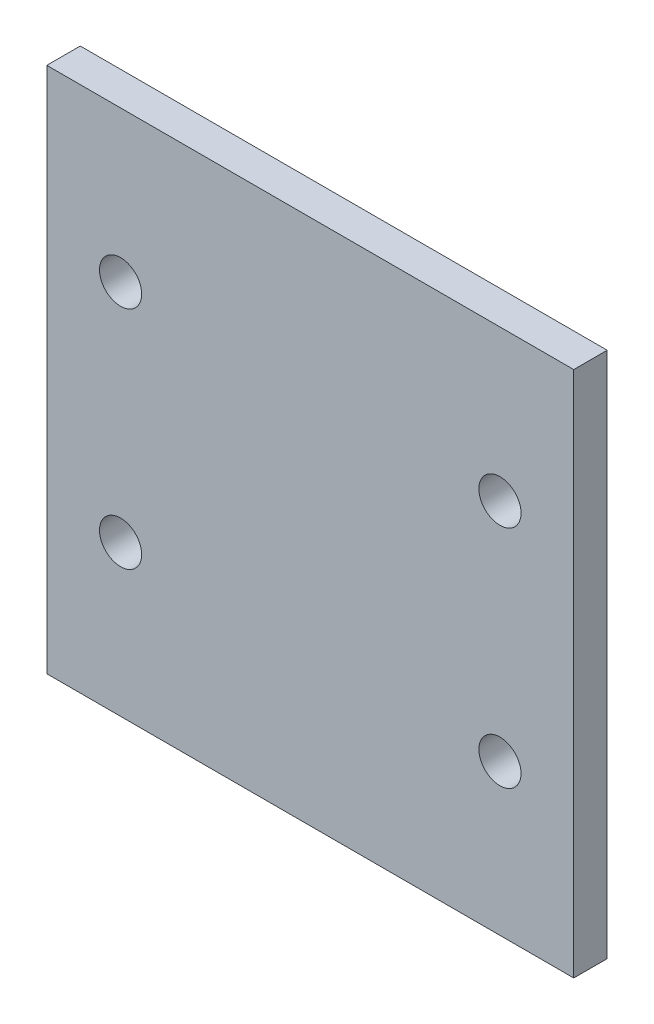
ISO-10303-21;
HEADER;
FILE_DESCRIPTION(('STEP AP214'),'2;1');
FILE_NAME('part.step','',(''),(''),'','','');
FILE_SCHEMA(('AUTOMOTIVE_DESIGN { 1 0 10303 214 1 1 1 1 }'));
ENDSEC;
DATA;
#1=APPLICATION_CONTEXT('core data for automotive mechanical design processes');
#2=APPLICATION_PROTOCOL_DEFINITION('international standard','automotive_design',2000,#1);
#3=PRODUCT_CONTEXT('',#1,'mechanical');
#4=PRODUCT('Part','Part','',(#3));
#5=PRODUCT_RELATED_PRODUCT_CATEGORY('part','',(#4));
#6=PRODUCT_DEFINITION_FORMATION('','',#4);
#7=PRODUCT_DEFINITION_CONTEXT('part definition',#1,'design');
#8=PRODUCT_DEFINITION('design','',#6,#7);
#9=PRODUCT_DEFINITION_SHAPE('','',#8);
#10=(LENGTH_UNIT() NAMED_UNIT(*) SI_UNIT(.MILLI.,.METRE.));
#11=(NAMED_UNIT(*) PLANE_ANGLE_UNIT() SI_UNIT($,.RADIAN.));
#12=(NAMED_UNIT(*) SI_UNIT($,.STERADIAN.) SOLID_ANGLE_UNIT());
#13=UNCERTAINTY_MEASURE_WITH_UNIT(LENGTH_MEASURE(1.E-05),#10,'distance_accuracy_value','');
#14=(GEOMETRIC_REPRESENTATION_CONTEXT(3) GLOBAL_UNCERTAINTY_ASSIGNED_CONTEXT((#13)) GLOBAL_UNIT_ASSIGNED_CONTEXT((#10,
#11,#12)) REPRESENTATION_CONTEXT('',''));
#15=CARTESIAN_POINT('',(0.,0.,0.));
#16=DIRECTION('',(0.,0.,1.));
#17=DIRECTION('',(1.,0.,0.));
#18=AXIS2_PLACEMENT_3D('',#15,#16,#17);
#19=CARTESIAN_POINT('',(0.,0.,1.5875));
#20=DIRECTION('',(0.,0.,-1.));
#21=DIRECTION('',(-1.,0.,0.));
#22=AXIS2_PLACEMENT_3D('',#19,#20,#21);
#23=PLANE('',#22);
#24=CARTESIAN_POINT('',(-8.99999999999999,-5.35,1.5875));
#25=DIRECTION('',(0.,0.,1.));
#26=DIRECTION('',(1.,0.,0.));
#27=AXIS2_PLACEMENT_3D('',#24,#25,#26);
#28=CIRCLE('',#27,1.);
#29=CARTESIAN_POINT('',(-7.99999999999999,-5.35,1.5875));
#30=VERTEX_POINT('',#29);
#31=EDGE_CURVE('E123',#30,#30,#28,.T.);
#32=ORIENTED_EDGE('',*,*,#31,.F.);
#33=EDGE_LOOP('',(#32));
#34=FACE_BOUND('',#33,.T.);
#35=CARTESIAN_POINT('',(-9.,5.35,1.5875));
#36=DIRECTION('',(0.,0.,1.));
#37=DIRECTION('',(1.,0.,0.));
#38=AXIS2_PLACEMENT_3D('',#35,#36,#37);
#39=CIRCLE('',#38,1.);
#40=CARTESIAN_POINT('',(-8.,5.35,1.5875));
#41=VERTEX_POINT('',#40);
#42=EDGE_CURVE('E102',#41,#41,#39,.T.);
#43=ORIENTED_EDGE('',*,*,#42,.F.);
#44=EDGE_LOOP('',(#43));
#45=FACE_BOUND('',#44,.T.);
#46=DIRECTION('',(0.,1.,0.));
#47=VECTOR('',#46,1.);
#48=CARTESIAN_POINT('',(12.5,-12.5,1.5875));
#49=LINE('',#48,#47);
#50=CARTESIAN_POINT('',(12.5,-12.5,1.5875));
#51=VERTEX_POINT('',#50);
#52=CARTESIAN_POINT('',(12.5,12.5,1.5875));
#53=VERTEX_POINT('',#52);
#54=EDGE_CURVE('E87',#51,#53,#49,.T.);
#55=ORIENTED_EDGE('',*,*,#54,.T.);
#56=DIRECTION('',(-1.,0.,0.));
#57=VECTOR('',#56,1.);
#58=CARTESIAN_POINT('',(-12.5,12.5,1.5875));
#59=LINE('',#58,#57);
#60=CARTESIAN_POINT('',(-12.5,12.5,1.5875));
#61=VERTEX_POINT('',#60);
#62=EDGE_CURVE('E82',#53,#61,#59,.T.);
#63=ORIENTED_EDGE('',*,*,#62,.T.);
#64=DIRECTION('',(0.,-1.,0.));
#65=VECTOR('',#64,1.);
#66=CARTESIAN_POINT('',(-12.5,-12.5,1.5875));
#67=LINE('',#66,#65);
#68=CARTESIAN_POINT('',(-12.5,-12.5,1.5875));
#69=VERTEX_POINT('',#68);
#70=EDGE_CURVE('E85',#61,#69,#67,.T.);
#71=ORIENTED_EDGE('',*,*,#70,.T.);
#72=DIRECTION('',(1.,0.,0.));
#73=VECTOR('',#72,1.);
#74=CARTESIAN_POINT('',(-12.5,-12.5,1.5875));
#75=LINE('',#74,#73);
#76=EDGE_CURVE('E52',#69,#51,#75,.T.);
#77=ORIENTED_EDGE('',*,*,#76,.T.);
#78=EDGE_LOOP('',(#55,#63,#71,#77));
#79=FACE_BOUND('',#78,.T.);
#80=CARTESIAN_POINT('',(9.,5.35,1.5875));
#81=DIRECTION('',(0.,0.,1.));
#82=DIRECTION('',(1.,0.,0.));
#83=AXIS2_PLACEMENT_3D('',#80,#81,#82);
#84=CIRCLE('',#83,1.);
#85=CARTESIAN_POINT('',(10.,5.35,1.5875));
#86=VERTEX_POINT('',#85);
#87=EDGE_CURVE('E117',#86,#86,#84,.T.);
#88=ORIENTED_EDGE('',*,*,#87,.F.);
#89=EDGE_LOOP('',(#88));
#90=FACE_BOUND('',#89,.T.);
#91=CARTESIAN_POINT('',(9.,-5.35,1.5875));
#92=DIRECTION('',(0.,0.,1.));
#93=DIRECTION('',(1.,0.,0.));
#94=AXIS2_PLACEMENT_3D('',#91,#92,#93);
#95=CIRCLE('',#94,1.);
#96=CARTESIAN_POINT('',(10.,-5.35,1.5875));
#97=VERTEX_POINT('',#96);
#98=EDGE_CURVE('E129',#97,#97,#95,.T.);
#99=ORIENTED_EDGE('',*,*,#98,.F.);
#100=EDGE_LOOP('',(#99));
#101=FACE_BOUND('',#100,.T.);
#102=ADVANCED_FACE('F35',(#34,#45,#79,#90,#101),#23,.F.);
#103=CARTESIAN_POINT('',(0.,0.,0.));
#104=DIRECTION('',(0.,0.,-1.));
#105=DIRECTION('',(-1.,0.,0.));
#106=AXIS2_PLACEMENT_3D('',#103,#104,#105);
#107=PLANE('',#106);
#108=CARTESIAN_POINT('',(-8.99999999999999,-5.35,0.));
#109=DIRECTION('',(0.,0.,1.));
#110=DIRECTION('',(1.,0.,0.));
#111=AXIS2_PLACEMENT_3D('',#108,#109,#110);
#112=CIRCLE('',#111,1.);
#113=CARTESIAN_POINT('',(-7.99999999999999,-5.35,0.));
#114=VERTEX_POINT('',#113);
#115=EDGE_CURVE('E126',#114,#114,#112,.T.);
#116=ORIENTED_EDGE('',*,*,#115,.T.);
#117=EDGE_LOOP('',(#116));
#118=FACE_BOUND('',#117,.T.);
#119=CARTESIAN_POINT('',(-9.,5.35,0.));
#120=DIRECTION('',(0.,0.,1.));
#121=DIRECTION('',(1.,0.,0.));
#122=AXIS2_PLACEMENT_3D('',#119,#120,#121);
#123=CIRCLE('',#122,1.);
#124=CARTESIAN_POINT('',(-8.,5.35,0.));
#125=VERTEX_POINT('',#124);
#126=EDGE_CURVE('E114',#125,#125,#123,.T.);
#127=ORIENTED_EDGE('',*,*,#126,.T.);
#128=EDGE_LOOP('',(#127));
#129=FACE_BOUND('',#128,.T.);
#130=DIRECTION('',(0.,1.,0.));
#131=VECTOR('',#130,1.);
#132=CARTESIAN_POINT('',(12.5,-12.5,0.));
#133=LINE('',#132,#131);
#134=CARTESIAN_POINT('',(12.5,-12.5,0.));
#135=VERTEX_POINT('',#134);
#136=CARTESIAN_POINT('',(12.5,12.5,0.));
#137=VERTEX_POINT('',#136);
#138=EDGE_CURVE('E99',#135,#137,#133,.T.);
#139=ORIENTED_EDGE('',*,*,#138,.F.);
#140=DIRECTION('',(1.,0.,0.));
#141=VECTOR('',#140,1.);
#142=CARTESIAN_POINT('',(-12.5,-12.5,0.));
#143=LINE('',#142,#141);
#144=CARTESIAN_POINT('',(-12.5,-12.5,0.));
#145=VERTEX_POINT('',#144);
#146=EDGE_CURVE('E75',#145,#135,#143,.T.);
#147=ORIENTED_EDGE('',*,*,#146,.F.);
#148=DIRECTION('',(0.,-1.,0.));
#149=VECTOR('',#148,1.);
#150=CARTESIAN_POINT('',(-12.5,-12.5,0.));
#151=LINE('',#150,#149);
#152=CARTESIAN_POINT('',(-12.5,12.5,0.));
#153=VERTEX_POINT('',#152);
#154=EDGE_CURVE('E69',#153,#145,#151,.T.);
#155=ORIENTED_EDGE('',*,*,#154,.F.);
#156=DIRECTION('',(-1.,0.,0.));
#157=VECTOR('',#156,1.);
#158=CARTESIAN_POINT('',(-12.5,12.5,0.));
#159=LINE('',#158,#157);
#160=EDGE_CURVE('E91',#137,#153,#159,.T.);
#161=ORIENTED_EDGE('',*,*,#160,.F.);
#162=EDGE_LOOP('',(#139,#147,#155,#161));
#163=FACE_BOUND('',#162,.T.);
#164=CARTESIAN_POINT('',(9.,5.35,0.));
#165=DIRECTION('',(0.,0.,1.));
#166=DIRECTION('',(1.,0.,0.));
#167=AXIS2_PLACEMENT_3D('',#164,#165,#166);
#168=CIRCLE('',#167,1.);
#169=CARTESIAN_POINT('',(10.,5.35,0.));
#170=VERTEX_POINT('',#169);
#171=EDGE_CURVE('E120',#170,#170,#168,.T.);
#172=ORIENTED_EDGE('',*,*,#171,.T.);
#173=EDGE_LOOP('',(#172));
#174=FACE_BOUND('',#173,.T.);
#175=CARTESIAN_POINT('',(9.,-5.35,0.));
#176=DIRECTION('',(0.,0.,1.));
#177=DIRECTION('',(1.,0.,0.));
#178=AXIS2_PLACEMENT_3D('',#175,#176,#177);
#179=CIRCLE('',#178,1.);
#180=CARTESIAN_POINT('',(10.,-5.35,0.));
#181=VERTEX_POINT('',#180);
#182=EDGE_CURVE('E132',#181,#181,#179,.T.);
#183=ORIENTED_EDGE('',*,*,#182,.T.);
#184=EDGE_LOOP('',(#183));
#185=FACE_BOUND('',#184,.T.);
#186=ADVANCED_FACE('F110',(#118,#129,#163,#174,#185),#107,.T.);
#187=CARTESIAN_POINT('',(12.5,-12.5,1.5875));
#188=DIRECTION('',(-1.,0.,0.));
#189=DIRECTION('',(0.,0.,1.));
#190=AXIS2_PLACEMENT_3D('',#187,#188,#189);
#191=PLANE('',#190);
#192=ORIENTED_EDGE('',*,*,#138,.T.);
#193=DIRECTION('',(0.,0.,-1.));
#194=VECTOR('',#193,1.);
#195=CARTESIAN_POINT('',(12.5,12.5,1.5875));
#196=LINE('',#195,#194);
#197=EDGE_CURVE('E11',#53,#137,#196,.T.);
#198=ORIENTED_EDGE('',*,*,#197,.F.);
#199=ORIENTED_EDGE('',*,*,#54,.F.);
#200=DIRECTION('',(0.,0.,-1.));
#201=VECTOR('',#200,1.);
#202=CARTESIAN_POINT('',(12.5,-12.5,1.5875));
#203=LINE('',#202,#201);
#204=EDGE_CURVE('E95',#51,#135,#203,.T.);
#205=ORIENTED_EDGE('',*,*,#204,.T.);
#206=EDGE_LOOP('',(#192,#198,#199,#205));
#207=FACE_BOUND('',#206,.T.);
#208=ADVANCED_FACE('F37',(#207),#191,.F.);
#209=CARTESIAN_POINT('',(-12.5,12.5,1.5875));
#210=DIRECTION('',(0.,-1.,0.));
#211=DIRECTION('',(0.,0.,-1.));
#212=AXIS2_PLACEMENT_3D('',#209,#210,#211);
#213=PLANE('',#212);
#214=ORIENTED_EDGE('',*,*,#160,.T.);
#215=DIRECTION('',(0.,0.,-1.));
#216=VECTOR('',#215,1.);
#217=CARTESIAN_POINT('',(-12.5,12.5,1.5875));
#218=LINE('',#217,#216);
#219=EDGE_CURVE('E44',#61,#153,#218,.T.);
#220=ORIENTED_EDGE('',*,*,#219,.F.);
#221=ORIENTED_EDGE('',*,*,#62,.F.);
#222=ORIENTED_EDGE('',*,*,#197,.T.);
#223=EDGE_LOOP('',(#214,#220,#221,#222));
#224=FACE_BOUND('',#223,.T.);
#225=ADVANCED_FACE('F90',(#224),#213,.F.);
#226=CARTESIAN_POINT('',(-12.5,-12.5,1.5875));
#227=DIRECTION('',(1.,0.,0.));
#228=DIRECTION('',(0.,0.,-1.));
#229=AXIS2_PLACEMENT_3D('',#226,#227,#228);
#230=PLANE('',#229);
#231=ORIENTED_EDGE('',*,*,#154,.T.);
#232=DIRECTION('',(0.,0.,-1.));
#233=VECTOR('',#232,1.);
#234=CARTESIAN_POINT('',(-12.5,-12.5,1.5875));
#235=LINE('',#234,#233);
#236=EDGE_CURVE('E92',#69,#145,#235,.T.);
#237=ORIENTED_EDGE('',*,*,#236,.F.);
#238=ORIENTED_EDGE('',*,*,#70,.F.);
#239=ORIENTED_EDGE('',*,*,#219,.T.);
#240=EDGE_LOOP('',(#231,#237,#238,#239));
#241=FACE_BOUND('',#240,.T.);
#242=ADVANCED_FACE('F93',(#241),#230,.F.);
#243=CARTESIAN_POINT('',(-12.5,-12.5,1.5875));
#244=DIRECTION('',(0.,1.,0.));
#245=DIRECTION('',(0.,0.,1.));
#246=AXIS2_PLACEMENT_3D('',#243,#244,#245);
#247=PLANE('',#246);
#248=ORIENTED_EDGE('',*,*,#146,.T.);
#249=ORIENTED_EDGE('',*,*,#204,.F.);
#250=ORIENTED_EDGE('',*,*,#76,.F.);
#251=ORIENTED_EDGE('',*,*,#236,.T.);
#252=EDGE_LOOP('',(#248,#249,#250,#251));
#253=FACE_BOUND('',#252,.T.);
#254=ADVANCED_FACE('F107',(#253),#247,.F.);
#255=CARTESIAN_POINT('',(-9.,5.35,1.5875));
#256=DIRECTION('',(0.,0.,-1.));
#257=DIRECTION('',(-1.,0.,0.));
#258=AXIS2_PLACEMENT_3D('',#255,#256,#257);
#259=CYLINDRICAL_SURFACE('',#258,1.);
#260=ORIENTED_EDGE('',*,*,#42,.T.);
#261=EDGE_LOOP('',(#260));
#262=FACE_BOUND('',#261,.T.);
#263=ORIENTED_EDGE('',*,*,#126,.F.);
#264=EDGE_LOOP('',(#263));
#265=FACE_BOUND('',#264,.T.);
#266=ADVANCED_FACE('F152',(#262,#265),#259,.F.);
#267=CARTESIAN_POINT('',(9.,5.35,1.5875));
#268=DIRECTION('',(0.,0.,-1.));
#269=DIRECTION('',(-1.,0.,0.));
#270=AXIS2_PLACEMENT_3D('',#267,#268,#269);
#271=CYLINDRICAL_SURFACE('',#270,1.);
#272=ORIENTED_EDGE('',*,*,#87,.T.);
#273=EDGE_LOOP('',(#272));
#274=FACE_BOUND('',#273,.T.);
#275=ORIENTED_EDGE('',*,*,#171,.F.);
#276=EDGE_LOOP('',(#275));
#277=FACE_BOUND('',#276,.T.);
#278=ADVANCED_FACE('F198',(#274,#277),#271,.F.);
#279=CARTESIAN_POINT('',(-8.99999999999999,-5.35,1.5875));
#280=DIRECTION('',(0.,0.,-1.));
#281=DIRECTION('',(-1.,0.,0.));
#282=AXIS2_PLACEMENT_3D('',#279,#280,#281);
#283=CYLINDRICAL_SURFACE('',#282,1.);
#284=ORIENTED_EDGE('',*,*,#31,.T.);
#285=EDGE_LOOP('',(#284));
#286=FACE_BOUND('',#285,.T.);
#287=ORIENTED_EDGE('',*,*,#115,.F.);
#288=EDGE_LOOP('',(#287));
#289=FACE_BOUND('',#288,.T.);
#290=ADVANCED_FACE('F206',(#286,#289),#283,.F.);
#291=CARTESIAN_POINT('',(9.,-5.35,1.5875));
#292=DIRECTION('',(0.,0.,-1.));
#293=DIRECTION('',(-1.,0.,0.));
#294=AXIS2_PLACEMENT_3D('',#291,#292,#293);
#295=CYLINDRICAL_SURFACE('',#294,1.);
#296=ORIENTED_EDGE('',*,*,#98,.T.);
#297=EDGE_LOOP('',(#296));
#298=FACE_BOUND('',#297,.T.);
#299=ORIENTED_EDGE('',*,*,#182,.F.);
#300=EDGE_LOOP('',(#299));
#301=FACE_BOUND('',#300,.T.);
#302=ADVANCED_FACE('F138',(#298,#301),#295,.F.);
#303=CLOSED_SHELL('',(#102,#186,#208,#225,#242,#254,#266,#278,#290,#302));
#304=MANIFOLD_SOLID_BREP('B2',#303);
#305=ADVANCED_BREP_SHAPE_REPRESENTATION('',(#18,#304),#14);
#306=SHAPE_DEFINITION_REPRESENTATION(#9,#305);
ENDSEC;
END-ISO-10303-21;
